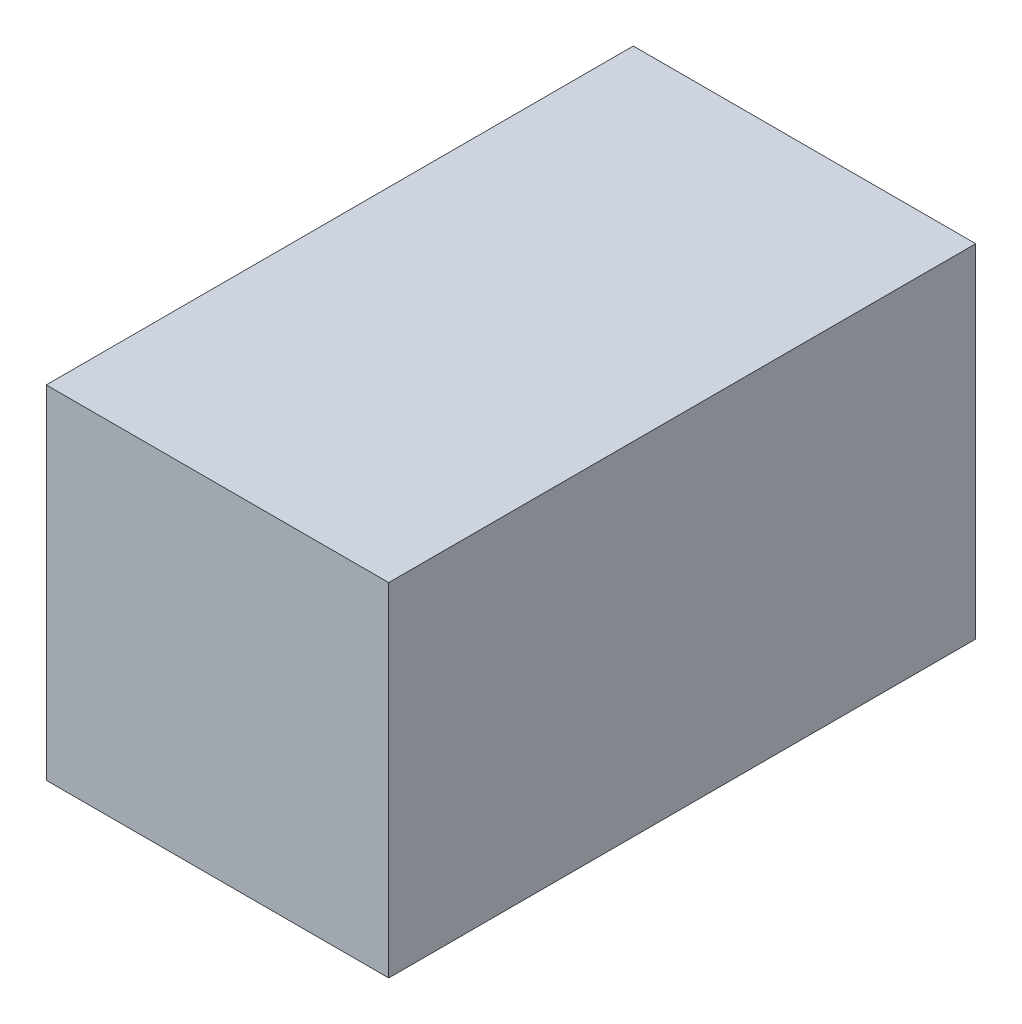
ISO-10303-21;
HEADER;
FILE_DESCRIPTION(('STEP AP214'),'2;1');
FILE_NAME('part.step','',(''),(''),'','','');
FILE_SCHEMA(('AUTOMOTIVE_DESIGN { 1 0 10303 214 1 1 1 1 }'));
ENDSEC;
DATA;
#1=APPLICATION_CONTEXT('core data for automotive mechanical design processes');
#2=APPLICATION_PROTOCOL_DEFINITION('international standard','automotive_design',2000,#1);
#3=PRODUCT_CONTEXT('',#1,'mechanical');
#4=PRODUCT('Part','Part','',(#3));
#5=PRODUCT_RELATED_PRODUCT_CATEGORY('part','',(#4));
#6=PRODUCT_DEFINITION_FORMATION('','',#4);
#7=PRODUCT_DEFINITION_CONTEXT('part definition',#1,'design');
#8=PRODUCT_DEFINITION('design','',#6,#7);
#9=PRODUCT_DEFINITION_SHAPE('','',#8);
#10=(LENGTH_UNIT() NAMED_UNIT(*) SI_UNIT(.MILLI.,.METRE.));
#11=(NAMED_UNIT(*) PLANE_ANGLE_UNIT() SI_UNIT($,.RADIAN.));
#12=(NAMED_UNIT(*) SI_UNIT($,.STERADIAN.) SOLID_ANGLE_UNIT());
#13=UNCERTAINTY_MEASURE_WITH_UNIT(LENGTH_MEASURE(1.E-05),#10,'distance_accuracy_value','');
#14=(GEOMETRIC_REPRESENTATION_CONTEXT(3) GLOBAL_UNCERTAINTY_ASSIGNED_CONTEXT((#13)) GLOBAL_UNIT_ASSIGNED_CONTEXT((#10,
#11,#12)) REPRESENTATION_CONTEXT('',''));
#15=CARTESIAN_POINT('',(0.,0.,0.));
#16=DIRECTION('',(0.,0.,1.));
#17=DIRECTION('',(1.,0.,0.));
#18=AXIS2_PLACEMENT_3D('',#15,#16,#17);
#19=CARTESIAN_POINT('',(88.9,-88.9,304.8));
#20=DIRECTION('',(-1.,0.,0.));
#21=DIRECTION('',(0.,0.,1.));
#22=AXIS2_PLACEMENT_3D('',#19,#20,#21);
#23=PLANE('',#22);
#24=DIRECTION('',(0.,1.,0.));
#25=VECTOR('',#24,1.);
#26=CARTESIAN_POINT('',(88.9,-88.9,0.));
#27=LINE('',#26,#25);
#28=CARTESIAN_POINT('',(88.9,-88.9,0.));
#29=VERTEX_POINT('',#28);
#30=CARTESIAN_POINT('',(88.9,88.9,0.));
#31=VERTEX_POINT('',#30);
#32=EDGE_CURVE('E97',#29,#31,#27,.T.);
#33=ORIENTED_EDGE('',*,*,#32,.T.);
#34=DIRECTION('',(0.,0.,-1.));
#35=VECTOR('',#34,1.);
#36=CARTESIAN_POINT('',(88.9,88.9,304.8));
#37=LINE('',#36,#35);
#38=CARTESIAN_POINT('',(88.9,88.9,304.8));
#39=VERTEX_POINT('',#38);
#40=EDGE_CURVE('E11',#39,#31,#37,.T.);
#41=ORIENTED_EDGE('',*,*,#40,.F.);
#42=DIRECTION('',(0.,1.,0.));
#43=VECTOR('',#42,1.);
#44=CARTESIAN_POINT('',(88.9,-88.9,304.8));
#45=LINE('',#44,#43);
#46=CARTESIAN_POINT('',(88.9,-88.9,304.8));
#47=VERTEX_POINT('',#46);
#48=EDGE_CURVE('E85',#47,#39,#45,.T.);
#49=ORIENTED_EDGE('',*,*,#48,.F.);
#50=DIRECTION('',(0.,0.,-1.));
#51=VECTOR('',#50,1.);
#52=CARTESIAN_POINT('',(88.9,-88.9,304.8));
#53=LINE('',#52,#51);
#54=EDGE_CURVE('E93',#47,#29,#53,.T.);
#55=ORIENTED_EDGE('',*,*,#54,.T.);
#56=EDGE_LOOP('',(#33,#41,#49,#55));
#57=FACE_BOUND('',#56,.T.);
#58=ADVANCED_FACE('F34',(#57),#23,.F.);
#59=CARTESIAN_POINT('',(-88.9,88.9,304.8));
#60=DIRECTION('',(0.,-1.,0.));
#61=DIRECTION('',(0.,0.,-1.));
#62=AXIS2_PLACEMENT_3D('',#59,#60,#61);
#63=PLANE('',#62);
#64=DIRECTION('',(-1.,0.,0.));
#65=VECTOR('',#64,1.);
#66=CARTESIAN_POINT('',(-88.9,88.9,0.));
#67=LINE('',#66,#65);
#68=CARTESIAN_POINT('',(-88.9,88.9,0.));
#69=VERTEX_POINT('',#68);
#70=EDGE_CURVE('E89',#31,#69,#67,.T.);
#71=ORIENTED_EDGE('',*,*,#70,.T.);
#72=DIRECTION('',(0.,0.,-1.));
#73=VECTOR('',#72,1.);
#74=CARTESIAN_POINT('',(-88.9,88.9,304.8));
#75=LINE('',#74,#73);
#76=CARTESIAN_POINT('',(-88.9,88.9,304.8));
#77=VERTEX_POINT('',#76);
#78=EDGE_CURVE('E42',#77,#69,#75,.T.);
#79=ORIENTED_EDGE('',*,*,#78,.F.);
#80=DIRECTION('',(-1.,0.,0.));
#81=VECTOR('',#80,1.);
#82=CARTESIAN_POINT('',(-88.9,88.9,304.8));
#83=LINE('',#82,#81);
#84=EDGE_CURVE('E80',#39,#77,#83,.T.);
#85=ORIENTED_EDGE('',*,*,#84,.F.);
#86=ORIENTED_EDGE('',*,*,#40,.T.);
#87=EDGE_LOOP('',(#71,#79,#85,#86));
#88=FACE_BOUND('',#87,.T.);
#89=ADVANCED_FACE('F88',(#88),#63,.F.);
#90=CARTESIAN_POINT('',(-88.9,-88.9,304.8));
#91=DIRECTION('',(1.,0.,0.));
#92=DIRECTION('',(0.,0.,-1.));
#93=AXIS2_PLACEMENT_3D('',#90,#91,#92);
#94=PLANE('',#93);
#95=DIRECTION('',(0.,-1.,0.));
#96=VECTOR('',#95,1.);
#97=CARTESIAN_POINT('',(-88.9,-88.9,0.));
#98=LINE('',#97,#96);
#99=CARTESIAN_POINT('',(-88.9,-88.9,0.));
#100=VERTEX_POINT('',#99);
#101=EDGE_CURVE('E67',#69,#100,#98,.T.);
#102=ORIENTED_EDGE('',*,*,#101,.T.);
#103=DIRECTION('',(0.,0.,-1.));
#104=VECTOR('',#103,1.);
#105=CARTESIAN_POINT('',(-88.9,-88.9,304.8));
#106=LINE('',#105,#104);
#107=CARTESIAN_POINT('',(-88.9,-88.9,304.8));
#108=VERTEX_POINT('',#107);
#109=EDGE_CURVE('E90',#108,#100,#106,.T.);
#110=ORIENTED_EDGE('',*,*,#109,.F.);
#111=DIRECTION('',(0.,-1.,0.));
#112=VECTOR('',#111,1.);
#113=CARTESIAN_POINT('',(-88.9,-88.9,304.8));
#114=LINE('',#113,#112);
#115=EDGE_CURVE('E83',#77,#108,#114,.T.);
#116=ORIENTED_EDGE('',*,*,#115,.F.);
#117=ORIENTED_EDGE('',*,*,#78,.T.);
#118=EDGE_LOOP('',(#102,#110,#116,#117));
#119=FACE_BOUND('',#118,.T.);
#120=ADVANCED_FACE('F91',(#119),#94,.F.);
#121=CARTESIAN_POINT('',(-88.9,-88.9,304.8));
#122=DIRECTION('',(0.,1.,0.));
#123=DIRECTION('',(0.,0.,1.));
#124=AXIS2_PLACEMENT_3D('',#121,#122,#123);
#125=PLANE('',#124);
#126=DIRECTION('',(1.,0.,0.));
#127=VECTOR('',#126,1.);
#128=CARTESIAN_POINT('',(-88.9,-88.9,0.));
#129=LINE('',#128,#127);
#130=EDGE_CURVE('E73',#100,#29,#129,.T.);
#131=ORIENTED_EDGE('',*,*,#130,.T.);
#132=ORIENTED_EDGE('',*,*,#54,.F.);
#133=DIRECTION('',(1.,0.,0.));
#134=VECTOR('',#133,1.);
#135=CARTESIAN_POINT('',(-88.9,-88.9,304.8));
#136=LINE('',#135,#134);
#137=EDGE_CURVE('E50',#108,#47,#136,.T.);
#138=ORIENTED_EDGE('',*,*,#137,.F.);
#139=ORIENTED_EDGE('',*,*,#109,.T.);
#140=EDGE_LOOP('',(#131,#132,#138,#139));
#141=FACE_BOUND('',#140,.T.);
#142=ADVANCED_FACE('F104',(#141),#125,.F.);
#143=CARTESIAN_POINT('',(88.9,88.9,304.8));
#144=DIRECTION('',(0.,0.,-1.));
#145=DIRECTION('',(-1.,0.,0.));
#146=AXIS2_PLACEMENT_3D('',#143,#144,#145);
#147=PLANE('',#146);
#148=ORIENTED_EDGE('',*,*,#48,.T.);
#149=ORIENTED_EDGE('',*,*,#84,.T.);
#150=ORIENTED_EDGE('',*,*,#115,.T.);
#151=ORIENTED_EDGE('',*,*,#137,.T.);
#152=EDGE_LOOP('',(#148,#149,#150,#151));
#153=FACE_BOUND('',#152,.T.);
#154=ADVANCED_FACE('F81',(#153),#147,.F.);
#155=CARTESIAN_POINT('',(88.9,88.9,0.));
#156=DIRECTION('',(0.,0.,-1.));
#157=DIRECTION('',(-1.,0.,0.));
#158=AXIS2_PLACEMENT_3D('',#155,#156,#157);
#159=PLANE('',#158);
#160=ORIENTED_EDGE('',*,*,#32,.F.);
#161=ORIENTED_EDGE('',*,*,#130,.F.);
#162=ORIENTED_EDGE('',*,*,#101,.F.);
#163=ORIENTED_EDGE('',*,*,#70,.F.);
#164=EDGE_LOOP('',(#160,#161,#162,#163));
#165=FACE_BOUND('',#164,.T.);
#166=ADVANCED_FACE('F107',(#165),#159,.T.);
#167=CLOSED_SHELL('',(#58,#89,#120,#142,#154,#166));
#168=MANIFOLD_SOLID_BREP('B2',#167);
#169=ADVANCED_BREP_SHAPE_REPRESENTATION('',(#18,#168),#14);
#170=SHAPE_DEFINITION_REPRESENTATION(#9,#169);
ENDSEC;
END-ISO-10303-21;
